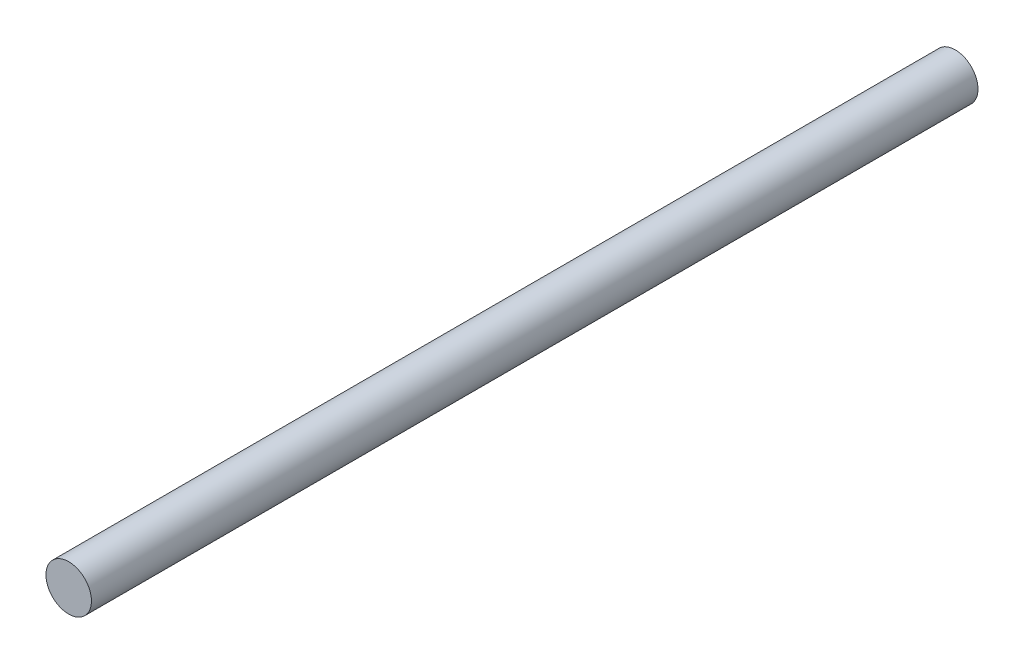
ISO-10303-21;
HEADER;
FILE_DESCRIPTION(('STEP AP214'),'2;1');
FILE_NAME('part.step','',(''),(''),'','','');
FILE_SCHEMA(('AUTOMOTIVE_DESIGN { 1 0 10303 214 1 1 1 1 }'));
ENDSEC;
DATA;
#1=APPLICATION_CONTEXT('core data for automotive mechanical design processes');
#2=APPLICATION_PROTOCOL_DEFINITION('international standard','automotive_design',2000,#1);
#3=PRODUCT_CONTEXT('',#1,'mechanical');
#4=PRODUCT('Part','Part','',(#3));
#5=PRODUCT_RELATED_PRODUCT_CATEGORY('part','',(#4));
#6=PRODUCT_DEFINITION_FORMATION('','',#4);
#7=PRODUCT_DEFINITION_CONTEXT('part definition',#1,'design');
#8=PRODUCT_DEFINITION('design','',#6,#7);
#9=PRODUCT_DEFINITION_SHAPE('','',#8);
#10=(LENGTH_UNIT() NAMED_UNIT(*) SI_UNIT(.MILLI.,.METRE.));
#11=(NAMED_UNIT(*) PLANE_ANGLE_UNIT() SI_UNIT($,.RADIAN.));
#12=(NAMED_UNIT(*) SI_UNIT($,.STERADIAN.) SOLID_ANGLE_UNIT());
#13=UNCERTAINTY_MEASURE_WITH_UNIT(LENGTH_MEASURE(1.E-05),#10,'distance_accuracy_value','');
#14=(GEOMETRIC_REPRESENTATION_CONTEXT(3) GLOBAL_UNCERTAINTY_ASSIGNED_CONTEXT((#13)) GLOBAL_UNIT_ASSIGNED_CONTEXT((#10,
#11,#12)) REPRESENTATION_CONTEXT('',''));
#15=CARTESIAN_POINT('',(0.,0.,0.));
#16=DIRECTION('',(0.,0.,1.));
#17=DIRECTION('',(1.,0.,0.));
#18=AXIS2_PLACEMENT_3D('',#15,#16,#17);
#19=CARTESIAN_POINT('',(0.,0.,390.));
#20=DIRECTION('',(0.,0.,-1.));
#21=DIRECTION('',(-1.,0.,0.));
#22=AXIS2_PLACEMENT_3D('',#19,#20,#21);
#23=CYLINDRICAL_SURFACE('',#22,10.);
#24=CARTESIAN_POINT('',(0.,0.,390.));
#25=DIRECTION('',(0.,0.,1.));
#26=DIRECTION('',(1.,0.,0.));
#27=AXIS2_PLACEMENT_3D('',#24,#25,#26);
#28=CIRCLE('',#27,10.);
#29=CARTESIAN_POINT('',(10.,0.,390.));
#30=VERTEX_POINT('',#29);
#31=EDGE_CURVE('E10',#30,#30,#28,.T.);
#32=ORIENTED_EDGE('',*,*,#31,.F.);
#33=EDGE_LOOP('',(#32));
#34=FACE_BOUND('',#33,.T.);
#35=CARTESIAN_POINT('',(0.,0.,0.));
#36=DIRECTION('',(0.,0.,1.));
#37=DIRECTION('',(1.,0.,0.));
#38=AXIS2_PLACEMENT_3D('',#35,#36,#37);
#39=CIRCLE('',#38,10.);
#40=CARTESIAN_POINT('',(10.,0.,0.));
#41=VERTEX_POINT('',#40);
#42=EDGE_CURVE('E33',#41,#41,#39,.T.);
#43=ORIENTED_EDGE('',*,*,#42,.T.);
#44=EDGE_LOOP('',(#43));
#45=FACE_BOUND('',#44,.T.);
#46=ADVANCED_FACE('F30',(#34,#45),#23,.T.);
#47=CARTESIAN_POINT('',(0.,0.,390.));
#48=DIRECTION('',(0.,0.,1.));
#49=DIRECTION('',(1.,0.,0.));
#50=AXIS2_PLACEMENT_3D('',#47,#48,#49);
#51=PLANE('',#50);
#52=ORIENTED_EDGE('',*,*,#31,.T.);
#53=EDGE_LOOP('',(#52));
#54=FACE_BOUND('',#53,.T.);
#55=ADVANCED_FACE('F45',(#54),#51,.T.);
#56=CARTESIAN_POINT('',(0.,0.,0.));
#57=DIRECTION('',(0.,0.,1.));
#58=DIRECTION('',(1.,0.,0.));
#59=AXIS2_PLACEMENT_3D('',#56,#57,#58);
#60=PLANE('',#59);
#61=ORIENTED_EDGE('',*,*,#42,.F.);
#62=EDGE_LOOP('',(#61));
#63=FACE_BOUND('',#62,.T.);
#64=ADVANCED_FACE('F43',(#63),#60,.F.);
#65=CLOSED_SHELL('',(#46,#55,#64));
#66=MANIFOLD_SOLID_BREP('B2',#65);
#67=ADVANCED_BREP_SHAPE_REPRESENTATION('',(#18,#66),#14);
#68=SHAPE_DEFINITION_REPRESENTATION(#9,#67);
ENDSEC;
END-ISO-10303-21;
